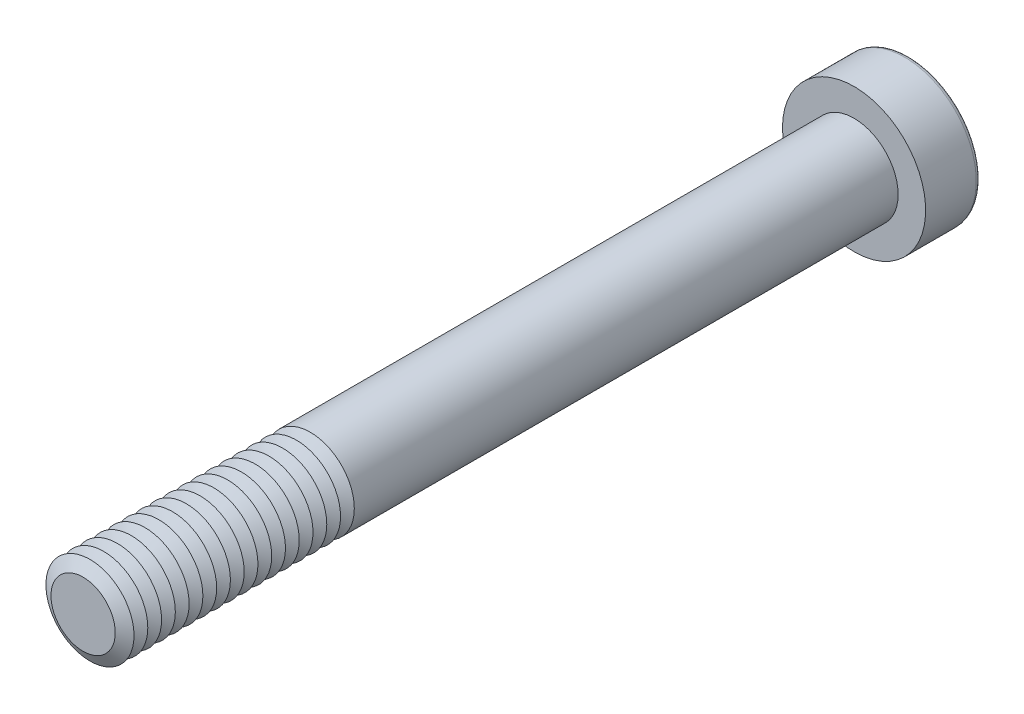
from build123d import *

# Parameters (mm, degrees)
SKETCH1_R           = 4
BOSS_EXTRUDE1_DEPTH = 70
SKETCH2_R           = 6.5
BOSS_EXTRUDE2_DEPTH = 5
CUT_EXTRUDE1_DEPTH  = 3.75
FILLET1_R           = 0.4
LPATTERN1_COUNT     = 17
LPATTERN1_PITCH     = 1.25


with BuildPart() as part:
    # Sketch1 → Boss-Extrude1 (new body)
    with BuildSketch(Plane.XY):
        Circle(SKETCH1_R)
    extrude(amount=BOSS_EXTRUDE1_DEPTH)

    # Sketch2 → Boss-Extrude2 (add)
    with BuildSketch(Plane(origin=(0, 0, 0), x_dir=(-1, 0, 0), z_dir=(0, 0, -1))):
        Circle(SKETCH2_R)
    extrude(amount=BOSS_EXTRUDE2_DEPTH)

    # Sketch3 → Cut-Extrude1 (cut)
    with BuildSketch(Plane(origin=(0, 0, -5), x_dir=(-1, 0, 0), z_dir=(0, 0, -1))):
        Polygon((-1.443375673, 2.5), (-2.886751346, 0), (-1.443375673, -2.5), (1.443375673, -2.5), (2.886751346, 0), (1.443375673, 2.5), align=None)
    extrude(amount=-CUT_EXTRUDE1_DEPTH, mode=Mode.SUBTRACT)

    # Fillet1
    fillet1_edges = [part.edges().sort_by_distance(p)[0] for p in [
        (6.5, 0, -5),
    ]]
    fillet(fillet1_edges, radius=FILLET1_R)

    # Cut-Extrude2 cone 1 section (on through the dimple's axis) → Cut-Extrude2 (revolve, cut)
    with BuildSketch(Plane(origin=(0, 0, -1.25), x_dir=(0, 1, 0), z_dir=(1, 0, 0))):
        Polygon((0, 0), (2.5, 0), (0, 1.443375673), align=None)
    revolve(axis=Axis((0, 0, -1.25), (0, 0, 1)), mode=Mode.SUBTRACT)

    # Cut-Extrude3 cone 1 section (on through the dimple's axis) → Cut-Extrude3 (revolve, cut)
    with BuildSketch(Plane(origin=(0, 0, -5), x_dir=(0, 1, 0), z_dir=(1, 0, 0))):
        Polygon((0, 0), (2.886751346, 0), (0, 0.773502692), align=None)
    revolve(axis=Axis((0, 0, -5), (0, 0, 1)), mode=Mode.SUBTRACT)

    # Sketch7 → Cut-Revolve1 (revolve, cut)
    with BuildSketch(Plane(origin=(0, 0, 0), x_dir=(0, 0, -1), z_dir=(1, 0, 0)), mode=Mode.PRIVATE) as cut_revolve1_sk:
        Polygon((-70, 2.917468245), (-69.375, 4), (-70.625, 4), align=None)
    cut_revolve1 = revolve(cut_revolve1_sk.sketch.rotate(Axis((0, 0, 70), (0, 0, -1)), 90), axis=Axis((0, 0, 70), (0, 0, -1)), mode=Mode.SUBTRACT)

    # LPattern1: Cut-Revolve1 ×17
    with Locations(*[(0, 0, -i * LPATTERN1_PITCH) for i in range(1, LPATTERN1_COUNT)]):
        add(cut_revolve1, mode=Mode.SUBTRACT)


solid = part.part
